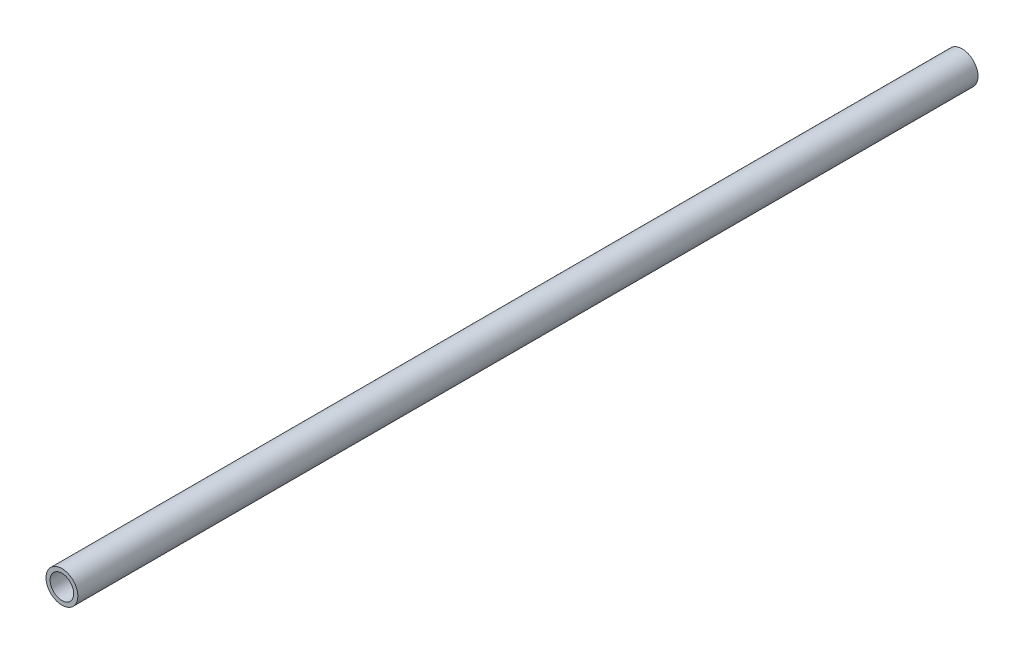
ISO-10303-21;
HEADER;
FILE_DESCRIPTION(('STEP AP214'),'2;1');
FILE_NAME('part.step','',(''),(''),'','','');
FILE_SCHEMA(('AUTOMOTIVE_DESIGN { 1 0 10303 214 1 1 1 1 }'));
ENDSEC;
DATA;
#1=APPLICATION_CONTEXT('core data for automotive mechanical design processes');
#2=APPLICATION_PROTOCOL_DEFINITION('international standard','automotive_design',2000,#1);
#3=PRODUCT_CONTEXT('',#1,'mechanical');
#4=PRODUCT('Part','Part','',(#3));
#5=PRODUCT_RELATED_PRODUCT_CATEGORY('part','',(#4));
#6=PRODUCT_DEFINITION_FORMATION('','',#4);
#7=PRODUCT_DEFINITION_CONTEXT('part definition',#1,'design');
#8=PRODUCT_DEFINITION('design','',#6,#7);
#9=PRODUCT_DEFINITION_SHAPE('','',#8);
#10=(LENGTH_UNIT() NAMED_UNIT(*) SI_UNIT(.MILLI.,.METRE.));
#11=(NAMED_UNIT(*) PLANE_ANGLE_UNIT() SI_UNIT($,.RADIAN.));
#12=(NAMED_UNIT(*) SI_UNIT($,.STERADIAN.) SOLID_ANGLE_UNIT());
#13=UNCERTAINTY_MEASURE_WITH_UNIT(LENGTH_MEASURE(1.E-05),#10,'distance_accuracy_value','');
#14=(GEOMETRIC_REPRESENTATION_CONTEXT(3) GLOBAL_UNCERTAINTY_ASSIGNED_CONTEXT((#13)) GLOBAL_UNIT_ASSIGNED_CONTEXT((#10,
#11,#12)) REPRESENTATION_CONTEXT('',''));
#15=CARTESIAN_POINT('',(0.,0.,0.));
#16=DIRECTION('',(0.,0.,1.));
#17=DIRECTION('',(1.,0.,0.));
#18=AXIS2_PLACEMENT_3D('',#15,#16,#17);
#19=CARTESIAN_POINT('',(0.,0.,304.8));
#20=DIRECTION('',(0.,0.,1.));
#21=DIRECTION('',(1.,0.,0.));
#22=AXIS2_PLACEMENT_3D('',#19,#20,#21);
#23=PLANE('',#22);
#24=CARTESIAN_POINT('',(0.,0.,304.8));
#25=DIRECTION('',(0.,0.,1.));
#26=DIRECTION('',(1.,0.,0.));
#27=AXIS2_PLACEMENT_3D('',#24,#25,#26);
#28=CIRCLE('',#27,10.7696);
#29=CARTESIAN_POINT('',(-10.7696,0.,304.8));
#30=VERTEX_POINT('',#29);
#31=EDGE_CURVE('E10',#30,#30,#28,.T.);
#32=ORIENTED_EDGE('',*,*,#31,.T.);
#33=EDGE_LOOP('',(#32));
#34=FACE_BOUND('',#33,.T.);
#35=CARTESIAN_POINT('',(0.,0.,304.8));
#36=DIRECTION('',(0.,0.,1.));
#37=DIRECTION('',(1.,0.,0.));
#38=AXIS2_PLACEMENT_3D('',#35,#36,#37);
#39=CIRCLE('',#38,8.001);
#40=CARTESIAN_POINT('',(-8.001,0.,304.8));
#41=VERTEX_POINT('',#40);
#42=EDGE_CURVE('E42',#41,#41,#39,.T.);
#43=ORIENTED_EDGE('',*,*,#42,.F.);
#44=EDGE_LOOP('',(#43));
#45=FACE_BOUND('',#44,.T.);
#46=ADVANCED_FACE('F31',(#34,#45),#23,.T.);
#47=CARTESIAN_POINT('',(0.,0.,-304.8));
#48=DIRECTION('',(0.,0.,1.));
#49=DIRECTION('',(1.,0.,0.));
#50=AXIS2_PLACEMENT_3D('',#47,#48,#49);
#51=PLANE('',#50);
#52=CARTESIAN_POINT('',(0.,0.,-304.8));
#53=DIRECTION('',(0.,0.,1.));
#54=DIRECTION('',(1.,0.,0.));
#55=AXIS2_PLACEMENT_3D('',#52,#53,#54);
#56=CIRCLE('',#55,10.7696);
#57=CARTESIAN_POINT('',(-10.7696,0.,-304.8));
#58=VERTEX_POINT('',#57);
#59=EDGE_CURVE('E35',#58,#58,#56,.T.);
#60=ORIENTED_EDGE('',*,*,#59,.F.);
#61=EDGE_LOOP('',(#60));
#62=FACE_BOUND('',#61,.T.);
#63=CARTESIAN_POINT('',(0.,0.,-304.8));
#64=DIRECTION('',(0.,0.,1.));
#65=DIRECTION('',(1.,0.,0.));
#66=AXIS2_PLACEMENT_3D('',#63,#64,#65);
#67=CIRCLE('',#66,8.001);
#68=CARTESIAN_POINT('',(-8.001,0.,-304.8));
#69=VERTEX_POINT('',#68);
#70=EDGE_CURVE('E44',#69,#69,#67,.T.);
#71=ORIENTED_EDGE('',*,*,#70,.T.);
#72=EDGE_LOOP('',(#71));
#73=FACE_BOUND('',#72,.T.);
#74=ADVANCED_FACE('F54',(#62,#73),#51,.F.);
#75=CARTESIAN_POINT('',(0.,0.,304.8));
#76=DIRECTION('',(0.,0.,-1.));
#77=DIRECTION('',(-1.,0.,0.));
#78=AXIS2_PLACEMENT_3D('',#75,#76,#77);
#79=CYLINDRICAL_SURFACE('',#78,10.7696);
#80=CARTESIAN_POINT('',(-10.7696,0.,304.8));
#81=CARTESIAN_POINT('',(-10.7696,0.,298.45));
#82=CARTESIAN_POINT('',(-10.7696,0.,292.1));
#83=CARTESIAN_POINT('',(-10.7696,0.,279.4));
#84=CARTESIAN_POINT('',(-10.7696,0.,273.05));
#85=CARTESIAN_POINT('',(-10.7696,0.,260.35));
#86=CARTESIAN_POINT('',(-10.7696,0.,254.));
#87=CARTESIAN_POINT('',(-10.7696,0.,241.3));
#88=CARTESIAN_POINT('',(-10.7696,0.,234.95));
#89=CARTESIAN_POINT('',(-10.7696,0.,222.25));
#90=CARTESIAN_POINT('',(-10.7696,0.,215.9));
#91=CARTESIAN_POINT('',(-10.7696,0.,203.2));
#92=CARTESIAN_POINT('',(-10.7696,0.,196.85));
#93=CARTESIAN_POINT('',(-10.7696,0.,184.15));
#94=CARTESIAN_POINT('',(-10.7696,0.,177.8));
#95=CARTESIAN_POINT('',(-10.7696,0.,165.1));
#96=CARTESIAN_POINT('',(-10.7696,0.,158.75));
#97=CARTESIAN_POINT('',(-10.7696,0.,146.05));
#98=CARTESIAN_POINT('',(-10.7696,0.,139.7));
#99=CARTESIAN_POINT('',(-10.7696,0.,127.));
#100=CARTESIAN_POINT('',(-10.7696,0.,120.65));
#101=CARTESIAN_POINT('',(-10.7696,0.,107.95));
#102=CARTESIAN_POINT('',(-10.7696,0.,101.6));
#103=CARTESIAN_POINT('',(-10.7696,0.,88.9));
#104=CARTESIAN_POINT('',(-10.7696,0.,82.55));
#105=CARTESIAN_POINT('',(-10.7696,0.,69.85));
#106=CARTESIAN_POINT('',(-10.7696,0.,63.5));
#107=CARTESIAN_POINT('',(-10.7696,0.,50.8));
#108=CARTESIAN_POINT('',(-10.7696,0.,44.45));
#109=CARTESIAN_POINT('',(-10.7696,0.,31.75));
#110=CARTESIAN_POINT('',(-10.7696,0.,25.4));
#111=CARTESIAN_POINT('',(-10.7696,0.,12.7));
#112=CARTESIAN_POINT('',(-10.7696,0.,6.35));
#113=CARTESIAN_POINT('',(-10.7696,0.,-6.35));
#114=CARTESIAN_POINT('',(-10.7696,0.,-12.7));
#115=CARTESIAN_POINT('',(-10.7696,0.,-25.4));
#116=CARTESIAN_POINT('',(-10.7696,0.,-31.75));
#117=CARTESIAN_POINT('',(-10.7696,0.,-44.45));
#118=CARTESIAN_POINT('',(-10.7696,0.,-50.8));
#119=CARTESIAN_POINT('',(-10.7696,0.,-63.5));
#120=CARTESIAN_POINT('',(-10.7696,0.,-69.85));
#121=CARTESIAN_POINT('',(-10.7696,0.,-82.55));
#122=CARTESIAN_POINT('',(-10.7696,0.,-88.9));
#123=CARTESIAN_POINT('',(-10.7696,0.,-101.6));
#124=CARTESIAN_POINT('',(-10.7696,0.,-107.95));
#125=CARTESIAN_POINT('',(-10.7696,0.,-120.65));
#126=CARTESIAN_POINT('',(-10.7696,0.,-127.));
#127=CARTESIAN_POINT('',(-10.7696,0.,-139.7));
#128=CARTESIAN_POINT('',(-10.7696,0.,-146.05));
#129=CARTESIAN_POINT('',(-10.7696,0.,-158.75));
#130=CARTESIAN_POINT('',(-10.7696,0.,-165.1));
#131=CARTESIAN_POINT('',(-10.7696,0.,-177.8));
#132=CARTESIAN_POINT('',(-10.7696,0.,-184.15));
#133=CARTESIAN_POINT('',(-10.7696,0.,-196.85));
#134=CARTESIAN_POINT('',(-10.7696,0.,-203.2));
#135=CARTESIAN_POINT('',(-10.7696,0.,-215.9));
#136=CARTESIAN_POINT('',(-10.7696,0.,-222.25));
#137=CARTESIAN_POINT('',(-10.7696,0.,-234.95));
#138=CARTESIAN_POINT('',(-10.7696,0.,-241.3));
#139=CARTESIAN_POINT('',(-10.7696,0.,-254.));
#140=CARTESIAN_POINT('',(-10.7696,0.,-260.35));
#141=CARTESIAN_POINT('',(-10.7696,0.,-273.05));
#142=CARTESIAN_POINT('',(-10.7696,0.,-279.4));
#143=CARTESIAN_POINT('',(-10.7696,0.,-292.1));
#144=CARTESIAN_POINT('',(-10.7696,0.,-298.45));
#145=CARTESIAN_POINT('',(-10.7696,0.,-304.8));
#146=B_SPLINE_CURVE_WITH_KNOTS('',3,(#80,#81,#82,#83,#84,#85,#86,#87,#88,#89,#90,#91,#92,#93,
#94,#95,#96,#97,#98,#99,#100,#101,#102,#103,#104,#105,#106,#107,#108,#109,#110,#111,#112,#113,
#114,#115,#116,#117,#118,#119,#120,#121,#122,#123,#124,#125,#126,#127,#128,#129,#130,#131,#132,
#133,#134,#135,#136,#137,#138,#139,#140,#141,#142,#143,#144,#145),.UNSPECIFIED.,.F.,.F.,(4,2,2,
2,2,2,2,2,2,2,2,2,2,2,2,2,2,2,2,2,2,2,2,2,2,2,2,2,2,2,2,2,4),(0.,19.05,38.1,57.15,76.2,
95.2500000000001,114.3,133.35,152.4,171.45,190.5,209.55,228.6,247.65,266.7,285.75,304.8,323.85,
342.9,361.95,381.,400.05,419.1,438.15,457.2,476.25,495.3,514.35,533.4,552.45,571.5,590.55,
609.6),.UNSPECIFIED.);
#147=EDGE_CURVE('BSEAM33',#30,#58,#146,.T.);
#148=ORIENTED_EDGE('',*,*,#31,.F.);
#149=ORIENTED_EDGE('',*,*,#59,.T.);
#150=ORIENTED_EDGE('',*,*,#147,.T.);
#151=ORIENTED_EDGE('',*,*,#147,.F.);
#152=EDGE_LOOP('',(#148,#150,#149,#151));
#153=FACE_BOUND('',#152,.T.);
#154=ADVANCED_FACE('F33',(#153),#79,.T.);
#155=CARTESIAN_POINT('',(0.,0.,304.8));
#156=DIRECTION('',(0.,0.,-1.));
#157=DIRECTION('',(-1.,0.,0.));
#158=AXIS2_PLACEMENT_3D('',#155,#156,#157);
#159=CYLINDRICAL_SURFACE('',#158,8.001);
#160=CARTESIAN_POINT('',(-8.001,0.,304.8));
#161=CARTESIAN_POINT('',(-8.001,0.,298.45));
#162=CARTESIAN_POINT('',(-8.001,0.,292.1));
#163=CARTESIAN_POINT('',(-8.001,0.,279.4));
#164=CARTESIAN_POINT('',(-8.001,0.,273.05));
#165=CARTESIAN_POINT('',(-8.001,0.,260.35));
#166=CARTESIAN_POINT('',(-8.001,0.,254.));
#167=CARTESIAN_POINT('',(-8.001,0.,241.3));
#168=CARTESIAN_POINT('',(-8.001,0.,234.95));
#169=CARTESIAN_POINT('',(-8.001,0.,222.25));
#170=CARTESIAN_POINT('',(-8.001,0.,215.9));
#171=CARTESIAN_POINT('',(-8.001,0.,203.2));
#172=CARTESIAN_POINT('',(-8.001,0.,196.85));
#173=CARTESIAN_POINT('',(-8.001,0.,184.15));
#174=CARTESIAN_POINT('',(-8.001,0.,177.8));
#175=CARTESIAN_POINT('',(-8.001,0.,165.1));
#176=CARTESIAN_POINT('',(-8.001,0.,158.75));
#177=CARTESIAN_POINT('',(-8.001,0.,146.05));
#178=CARTESIAN_POINT('',(-8.001,0.,139.7));
#179=CARTESIAN_POINT('',(-8.001,0.,127.));
#180=CARTESIAN_POINT('',(-8.001,0.,120.65));
#181=CARTESIAN_POINT('',(-8.001,0.,107.95));
#182=CARTESIAN_POINT('',(-8.001,0.,101.6));
#183=CARTESIAN_POINT('',(-8.001,0.,88.9));
#184=CARTESIAN_POINT('',(-8.001,0.,82.55));
#185=CARTESIAN_POINT('',(-8.001,0.,69.85));
#186=CARTESIAN_POINT('',(-8.001,0.,63.5));
#187=CARTESIAN_POINT('',(-8.001,0.,50.8));
#188=CARTESIAN_POINT('',(-8.001,0.,44.45));
#189=CARTESIAN_POINT('',(-8.001,0.,31.75));
#190=CARTESIAN_POINT('',(-8.001,0.,25.4));
#191=CARTESIAN_POINT('',(-8.001,0.,12.7));
#192=CARTESIAN_POINT('',(-8.001,0.,6.34999999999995));
#193=CARTESIAN_POINT('',(-8.001,0.,-6.35000000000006));
#194=CARTESIAN_POINT('',(-8.001,0.,-12.7000000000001));
#195=CARTESIAN_POINT('',(-8.001,0.,-25.4000000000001));
#196=CARTESIAN_POINT('',(-8.001,0.,-31.7500000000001));
#197=CARTESIAN_POINT('',(-8.001,0.,-44.4500000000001));
#198=CARTESIAN_POINT('',(-8.001,0.,-50.8000000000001));
#199=CARTESIAN_POINT('',(-8.001,0.,-63.5000000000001));
#200=CARTESIAN_POINT('',(-8.001,0.,-69.8500000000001));
#201=CARTESIAN_POINT('',(-8.001,0.,-82.5500000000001));
#202=CARTESIAN_POINT('',(-8.001,0.,-88.9000000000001));
#203=CARTESIAN_POINT('',(-8.001,0.,-101.6));
#204=CARTESIAN_POINT('',(-8.001,0.,-107.95));
#205=CARTESIAN_POINT('',(-8.001,0.,-120.65));
#206=CARTESIAN_POINT('',(-8.001,0.,-127.));
#207=CARTESIAN_POINT('',(-8.001,0.,-139.7));
#208=CARTESIAN_POINT('',(-8.001,0.,-146.05));
#209=CARTESIAN_POINT('',(-8.001,0.,-158.75));
#210=CARTESIAN_POINT('',(-8.001,0.,-165.1));
#211=CARTESIAN_POINT('',(-8.001,0.,-177.8));
#212=CARTESIAN_POINT('',(-8.001,0.,-184.15));
#213=CARTESIAN_POINT('',(-8.001,0.,-196.85));
#214=CARTESIAN_POINT('',(-8.001,0.,-203.2));
#215=CARTESIAN_POINT('',(-8.001,0.,-215.9));
#216=CARTESIAN_POINT('',(-8.001,0.,-222.25));
#217=CARTESIAN_POINT('',(-8.001,0.,-234.95));
#218=CARTESIAN_POINT('',(-8.001,0.,-241.3));
#219=CARTESIAN_POINT('',(-8.001,0.,-254.));
#220=CARTESIAN_POINT('',(-8.001,0.,-260.35));
#221=CARTESIAN_POINT('',(-8.001,0.,-273.05));
#222=CARTESIAN_POINT('',(-8.001,0.,-279.4));
#223=CARTESIAN_POINT('',(-8.001,0.,-292.1));
#224=CARTESIAN_POINT('',(-8.001,0.,-298.45));
#225=CARTESIAN_POINT('',(-8.001,0.,-304.8));
#226=B_SPLINE_CURVE_WITH_KNOTS('',3,(#160,#161,#162,#163,#164,#165,#166,#167,#168,#169,#170,
#171,#172,#173,#174,#175,#176,#177,#178,#179,#180,#181,#182,#183,#184,#185,#186,#187,#188,#189,
#190,#191,#192,#193,#194,#195,#196,#197,#198,#199,#200,#201,#202,#203,#204,#205,#206,#207,#208,
#209,#210,#211,#212,#213,#214,#215,#216,#217,#218,#219,#220,#221,#222,#223,#224,#225),
.UNSPECIFIED.,.F.,.F.,(4,2,2,2,2,2,2,2,2,2,2,2,2,2,2,2,2,2,2,2,2,2,2,2,2,2,2,2,2,2,2,2,4),(0.,
19.05,38.1,57.15,76.2,95.25,114.3,133.35,152.4,171.45,190.5,209.55,228.6,247.65,266.7,285.75,
304.8,323.85,342.9,361.95,381.,400.05,419.1,438.15,457.2,476.25,495.3,514.35,533.4,552.45,571.5,
590.55,609.6),.UNSPECIFIED.);
#227=EDGE_CURVE('BSEAM50',#41,#69,#226,.T.);
#228=ORIENTED_EDGE('',*,*,#42,.T.);
#229=ORIENTED_EDGE('',*,*,#70,.F.);
#230=ORIENTED_EDGE('',*,*,#227,.T.);
#231=ORIENTED_EDGE('',*,*,#227,.F.);
#232=EDGE_LOOP('',(#228,#230,#229,#231));
#233=FACE_BOUND('',#232,.T.);
#234=ADVANCED_FACE('F50',(#233),#159,.F.);
#235=CLOSED_SHELL('',(#46,#74,#154,#234));
#236=MANIFOLD_SOLID_BREP('B2',#235);
#237=ADVANCED_BREP_SHAPE_REPRESENTATION('',(#18,#236),#14);
#238=SHAPE_DEFINITION_REPRESENTATION(#9,#237);
ENDSEC;
END-ISO-10303-21;
